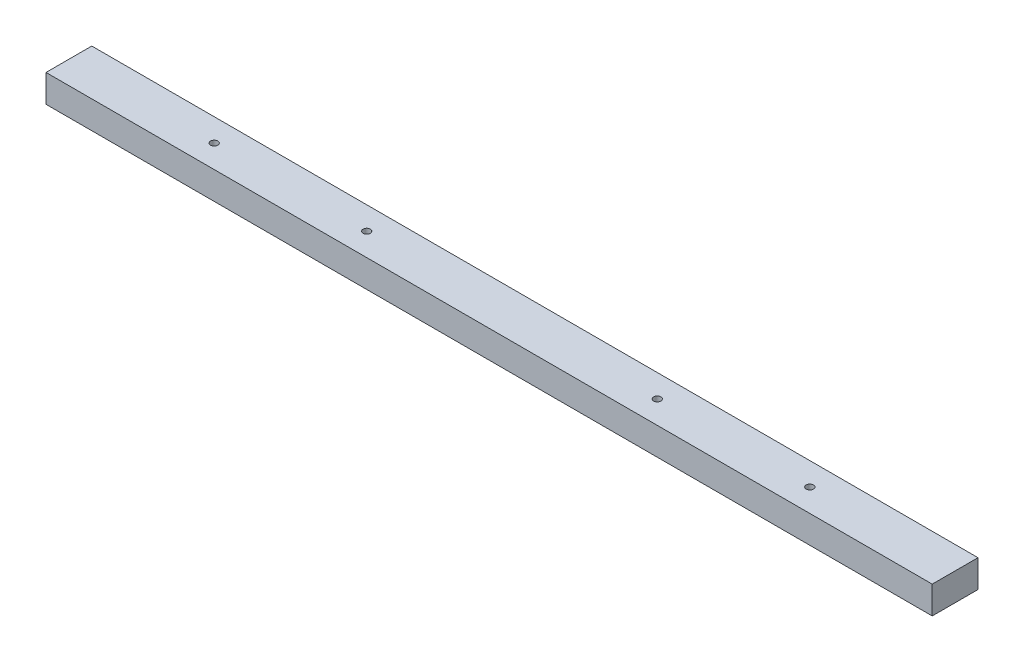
ISO-10303-21;
HEADER;
FILE_DESCRIPTION(('STEP AP214'),'2;1');
FILE_NAME('part.step','',(''),(''),'','','');
FILE_SCHEMA(('AUTOMOTIVE_DESIGN { 1 0 10303 214 1 1 1 1 }'));
ENDSEC;
DATA;
#1=APPLICATION_CONTEXT('core data for automotive mechanical design processes');
#2=APPLICATION_PROTOCOL_DEFINITION('international standard','automotive_design',2000,#1);
#3=PRODUCT_CONTEXT('',#1,'mechanical');
#4=PRODUCT('Part','Part','',(#3));
#5=PRODUCT_RELATED_PRODUCT_CATEGORY('part','',(#4));
#6=PRODUCT_DEFINITION_FORMATION('','',#4);
#7=PRODUCT_DEFINITION_CONTEXT('part definition',#1,'design');
#8=PRODUCT_DEFINITION('design','',#6,#7);
#9=PRODUCT_DEFINITION_SHAPE('','',#8);
#10=(LENGTH_UNIT() NAMED_UNIT(*) SI_UNIT(.MILLI.,.METRE.));
#11=(NAMED_UNIT(*) PLANE_ANGLE_UNIT() SI_UNIT($,.RADIAN.));
#12=(NAMED_UNIT(*) SI_UNIT($,.STERADIAN.) SOLID_ANGLE_UNIT());
#13=UNCERTAINTY_MEASURE_WITH_UNIT(LENGTH_MEASURE(1.E-05),#10,'distance_accuracy_value','');
#14=(GEOMETRIC_REPRESENTATION_CONTEXT(3) GLOBAL_UNCERTAINTY_ASSIGNED_CONTEXT((#13)) GLOBAL_UNIT_ASSIGNED_CONTEXT((#10,
#11,#12)) REPRESENTATION_CONTEXT('',''));
#15=CARTESIAN_POINT('',(0.,0.,0.));
#16=DIRECTION('',(0.,0.,1.));
#17=DIRECTION('',(1.,0.,0.));
#18=AXIS2_PLACEMENT_3D('',#15,#16,#17);
#19=CARTESIAN_POINT('',(0.,38.,0.));
#20=DIRECTION('',(1.,0.,0.));
#21=DIRECTION('',(0.,0.,-1.));
#22=AXIS2_PLACEMENT_3D('',#19,#20,#21);
#23=PLANE('',#22);
#24=DIRECTION('',(0.,0.,1.));
#25=VECTOR('',#24,1.);
#26=CARTESIAN_POINT('',(0.,0.,0.));
#27=LINE('',#26,#25);
#28=CARTESIAN_POINT('',(0.,0.,-63.));
#29=VERTEX_POINT('',#28);
#30=CARTESIAN_POINT('',(0.,0.,0.));
#31=VERTEX_POINT('',#30);
#32=EDGE_CURVE('E96',#29,#31,#27,.T.);
#33=ORIENTED_EDGE('',*,*,#32,.T.);
#34=DIRECTION('',(0.,-1.,0.));
#35=VECTOR('',#34,1.);
#36=CARTESIAN_POINT('',(0.,38.,0.));
#37=LINE('',#36,#35);
#38=CARTESIAN_POINT('',(0.,38.,0.));
#39=VERTEX_POINT('',#38);
#40=EDGE_CURVE('E11',#39,#31,#37,.T.);
#41=ORIENTED_EDGE('',*,*,#40,.F.);
#42=DIRECTION('',(0.,0.,1.));
#43=VECTOR('',#42,1.);
#44=CARTESIAN_POINT('',(0.,38.,0.));
#45=LINE('',#44,#43);
#46=CARTESIAN_POINT('',(0.,38.,-63.));
#47=VERTEX_POINT('',#46);
#48=EDGE_CURVE('E84',#47,#39,#45,.T.);
#49=ORIENTED_EDGE('',*,*,#48,.F.);
#50=DIRECTION('',(0.,-1.,0.));
#51=VECTOR('',#50,1.);
#52=CARTESIAN_POINT('',(0.,38.,-63.));
#53=LINE('',#52,#51);
#54=EDGE_CURVE('E92',#47,#29,#53,.T.);
#55=ORIENTED_EDGE('',*,*,#54,.T.);
#56=EDGE_LOOP('',(#33,#41,#49,#55));
#57=FACE_BOUND('',#56,.T.);
#58=ADVANCED_FACE('F33',(#57),#23,.F.);
#59=CARTESIAN_POINT('',(0.,38.,0.));
#60=DIRECTION('',(0.,0.,-1.));
#61=DIRECTION('',(-1.,0.,0.));
#62=AXIS2_PLACEMENT_3D('',#59,#60,#61);
#63=PLANE('',#62);
#64=DIRECTION('',(1.,0.,0.));
#65=VECTOR('',#64,1.);
#66=CARTESIAN_POINT('',(0.,0.,0.));
#67=LINE('',#66,#65);
#68=CARTESIAN_POINT('',(1220.,0.,0.));
#69=VERTEX_POINT('',#68);
#70=EDGE_CURVE('E88',#31,#69,#67,.T.);
#71=ORIENTED_EDGE('',*,*,#70,.T.);
#72=DIRECTION('',(0.,-1.,0.));
#73=VECTOR('',#72,1.);
#74=CARTESIAN_POINT('',(1220.,38.,0.));
#75=LINE('',#74,#73);
#76=CARTESIAN_POINT('',(1220.,38.,0.));
#77=VERTEX_POINT('',#76);
#78=EDGE_CURVE('E41',#77,#69,#75,.T.);
#79=ORIENTED_EDGE('',*,*,#78,.F.);
#80=DIRECTION('',(1.,0.,0.));
#81=VECTOR('',#80,1.);
#82=CARTESIAN_POINT('',(0.,38.,0.));
#83=LINE('',#82,#81);
#84=EDGE_CURVE('E79',#39,#77,#83,.T.);
#85=ORIENTED_EDGE('',*,*,#84,.F.);
#86=ORIENTED_EDGE('',*,*,#40,.T.);
#87=EDGE_LOOP('',(#71,#79,#85,#86));
#88=FACE_BOUND('',#87,.T.);
#89=ADVANCED_FACE('F87',(#88),#63,.F.);
#90=CARTESIAN_POINT('',(1220.,38.,0.));
#91=DIRECTION('',(-1.,0.,0.));
#92=DIRECTION('',(0.,0.,1.));
#93=AXIS2_PLACEMENT_3D('',#90,#91,#92);
#94=PLANE('',#93);
#95=DIRECTION('',(0.,0.,-1.));
#96=VECTOR('',#95,1.);
#97=CARTESIAN_POINT('',(1220.,0.,0.));
#98=LINE('',#97,#96);
#99=CARTESIAN_POINT('',(1220.,0.,-63.));
#100=VERTEX_POINT('',#99);
#101=EDGE_CURVE('E66',#69,#100,#98,.T.);
#102=ORIENTED_EDGE('',*,*,#101,.T.);
#103=DIRECTION('',(0.,-1.,0.));
#104=VECTOR('',#103,1.);
#105=CARTESIAN_POINT('',(1220.,38.,-63.));
#106=LINE('',#105,#104);
#107=CARTESIAN_POINT('',(1220.,38.,-63.));
#108=VERTEX_POINT('',#107);
#109=EDGE_CURVE('E89',#108,#100,#106,.T.);
#110=ORIENTED_EDGE('',*,*,#109,.F.);
#111=DIRECTION('',(0.,0.,-1.));
#112=VECTOR('',#111,1.);
#113=CARTESIAN_POINT('',(1220.,38.,0.));
#114=LINE('',#113,#112);
#115=EDGE_CURVE('E82',#77,#108,#114,.T.);
#116=ORIENTED_EDGE('',*,*,#115,.F.);
#117=ORIENTED_EDGE('',*,*,#78,.T.);
#118=EDGE_LOOP('',(#102,#110,#116,#117));
#119=FACE_BOUND('',#118,.T.);
#120=ADVANCED_FACE('F90',(#119),#94,.F.);
#121=CARTESIAN_POINT('',(0.,38.,-63.));
#122=DIRECTION('',(0.,0.,1.));
#123=DIRECTION('',(1.,0.,0.));
#124=AXIS2_PLACEMENT_3D('',#121,#122,#123);
#125=PLANE('',#124);
#126=DIRECTION('',(-1.,0.,0.));
#127=VECTOR('',#126,1.);
#128=CARTESIAN_POINT('',(0.,0.,-63.));
#129=LINE('',#128,#127);
#130=EDGE_CURVE('E72',#100,#29,#129,.T.);
#131=ORIENTED_EDGE('',*,*,#130,.T.);
#132=ORIENTED_EDGE('',*,*,#54,.F.);
#133=DIRECTION('',(-1.,0.,0.));
#134=VECTOR('',#133,1.);
#135=CARTESIAN_POINT('',(0.,38.,-63.));
#136=LINE('',#135,#134);
#137=EDGE_CURVE('E49',#108,#47,#136,.T.);
#138=ORIENTED_EDGE('',*,*,#137,.F.);
#139=ORIENTED_EDGE('',*,*,#109,.T.);
#140=EDGE_LOOP('',(#131,#132,#138,#139));
#141=FACE_BOUND('',#140,.T.);
#142=ADVANCED_FACE('F104',(#141),#125,.F.);
#143=CARTESIAN_POINT('',(0.,38.,0.));
#144=DIRECTION('',(0.,-1.,0.));
#145=DIRECTION('',(0.,0.,-1.));
#146=AXIS2_PLACEMENT_3D('',#143,#144,#145);
#147=PLANE('',#146);
#148=CARTESIAN_POINT('',(200.,38.,-31.5));
#149=DIRECTION('',(0.,1.,0.));
#150=DIRECTION('',(0.,0.,1.));
#151=AXIS2_PLACEMENT_3D('',#148,#149,#150);
#152=CIRCLE('',#151,4.99999999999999);
#153=CARTESIAN_POINT('',(200.,38.,-26.5));
#154=VERTEX_POINT('',#153);
#155=EDGE_CURVE('E128',#154,#154,#152,.T.);
#156=ORIENTED_EDGE('',*,*,#155,.F.);
#157=EDGE_LOOP('',(#156));
#158=FACE_BOUND('',#157,.T.);
#159=CARTESIAN_POINT('',(410.,38.,-31.5));
#160=DIRECTION('',(0.,1.,0.));
#161=DIRECTION('',(0.,0.,1.));
#162=AXIS2_PLACEMENT_3D('',#159,#160,#161);
#163=CIRCLE('',#162,5.00000000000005);
#164=CARTESIAN_POINT('',(410.,38.,-26.5));
#165=VERTEX_POINT('',#164);
#166=EDGE_CURVE('E122',#165,#165,#163,.T.);
#167=ORIENTED_EDGE('',*,*,#166,.F.);
#168=EDGE_LOOP('',(#167));
#169=FACE_BOUND('',#168,.T.);
#170=CARTESIAN_POINT('',(810.,38.,-31.5));
#171=DIRECTION('',(0.,1.,0.));
#172=DIRECTION('',(0.,0.,-1.));
#173=AXIS2_PLACEMENT_3D('',#170,#171,#172);
#174=CIRCLE('',#173,5.00000000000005);
#175=CARTESIAN_POINT('',(810.,38.,-36.5));
#176=VERTEX_POINT('',#175);
#177=EDGE_CURVE('E116',#176,#176,#174,.T.);
#178=ORIENTED_EDGE('',*,*,#177,.F.);
#179=EDGE_LOOP('',(#178));
#180=FACE_BOUND('',#179,.T.);
#181=CARTESIAN_POINT('',(1020.,38.,-31.5));
#182=DIRECTION('',(0.,1.,0.));
#183=DIRECTION('',(0.,0.,-1.));
#184=AXIS2_PLACEMENT_3D('',#181,#182,#183);
#185=CIRCLE('',#184,5.00000000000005);
#186=CARTESIAN_POINT('',(1020.,38.,-36.5));
#187=VERTEX_POINT('',#186);
#188=EDGE_CURVE('E110',#187,#187,#185,.T.);
#189=ORIENTED_EDGE('',*,*,#188,.F.);
#190=EDGE_LOOP('',(#189));
#191=FACE_BOUND('',#190,.T.);
#192=ORIENTED_EDGE('',*,*,#48,.T.);
#193=ORIENTED_EDGE('',*,*,#84,.T.);
#194=ORIENTED_EDGE('',*,*,#115,.T.);
#195=ORIENTED_EDGE('',*,*,#137,.T.);
#196=EDGE_LOOP('',(#192,#193,#194,#195));
#197=FACE_BOUND('',#196,.T.);
#198=ADVANCED_FACE('F80',(#158,#169,#180,#191,#197),#147,.F.);
#199=CARTESIAN_POINT('',(0.,0.,0.));
#200=DIRECTION('',(0.,-1.,0.));
#201=DIRECTION('',(0.,0.,-1.));
#202=AXIS2_PLACEMENT_3D('',#199,#200,#201);
#203=PLANE('',#202);
#204=CARTESIAN_POINT('',(200.,0.,-31.5));
#205=DIRECTION('',(0.,1.,0.));
#206=DIRECTION('',(0.,0.,1.));
#207=AXIS2_PLACEMENT_3D('',#204,#205,#206);
#208=CIRCLE('',#207,4.99999999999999);
#209=CARTESIAN_POINT('',(200.,0.,-26.5));
#210=VERTEX_POINT('',#209);
#211=EDGE_CURVE('E99',#210,#210,#208,.T.);
#212=ORIENTED_EDGE('',*,*,#211,.T.);
#213=EDGE_LOOP('',(#212));
#214=FACE_BOUND('',#213,.T.);
#215=CARTESIAN_POINT('',(410.,0.,-31.5));
#216=DIRECTION('',(0.,1.,0.));
#217=DIRECTION('',(0.,0.,1.));
#218=AXIS2_PLACEMENT_3D('',#215,#216,#217);
#219=CIRCLE('',#218,5.00000000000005);
#220=CARTESIAN_POINT('',(410.,0.,-26.5));
#221=VERTEX_POINT('',#220);
#222=EDGE_CURVE('E125',#221,#221,#219,.T.);
#223=ORIENTED_EDGE('',*,*,#222,.T.);
#224=EDGE_LOOP('',(#223));
#225=FACE_BOUND('',#224,.T.);
#226=CARTESIAN_POINT('',(810.,0.,-31.5));
#227=DIRECTION('',(0.,1.,0.));
#228=DIRECTION('',(0.,0.,-1.));
#229=AXIS2_PLACEMENT_3D('',#226,#227,#228);
#230=CIRCLE('',#229,5.00000000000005);
#231=CARTESIAN_POINT('',(810.,0.,-36.5));
#232=VERTEX_POINT('',#231);
#233=EDGE_CURVE('E119',#232,#232,#230,.T.);
#234=ORIENTED_EDGE('',*,*,#233,.T.);
#235=EDGE_LOOP('',(#234));
#236=FACE_BOUND('',#235,.T.);
#237=CARTESIAN_POINT('',(1020.,0.,-31.5));
#238=DIRECTION('',(0.,1.,0.));
#239=DIRECTION('',(0.,0.,-1.));
#240=AXIS2_PLACEMENT_3D('',#237,#238,#239);
#241=CIRCLE('',#240,5.00000000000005);
#242=CARTESIAN_POINT('',(1020.,0.,-36.5));
#243=VERTEX_POINT('',#242);
#244=EDGE_CURVE('E113',#243,#243,#241,.T.);
#245=ORIENTED_EDGE('',*,*,#244,.T.);
#246=EDGE_LOOP('',(#245));
#247=FACE_BOUND('',#246,.T.);
#248=ORIENTED_EDGE('',*,*,#32,.F.);
#249=ORIENTED_EDGE('',*,*,#130,.F.);
#250=ORIENTED_EDGE('',*,*,#101,.F.);
#251=ORIENTED_EDGE('',*,*,#70,.F.);
#252=EDGE_LOOP('',(#248,#249,#250,#251));
#253=FACE_BOUND('',#252,.T.);
#254=ADVANCED_FACE('F107',(#214,#225,#236,#247,#253),#203,.T.);
#255=CARTESIAN_POINT('',(1020.,0.,-31.5));
#256=DIRECTION('',(0.,1.,0.));
#257=DIRECTION('',(0.,0.,1.));
#258=AXIS2_PLACEMENT_3D('',#255,#256,#257);
#259=CYLINDRICAL_SURFACE('',#258,5.00000000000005);
#260=ORIENTED_EDGE('',*,*,#244,.F.);
#261=EDGE_LOOP('',(#260));
#262=FACE_BOUND('',#261,.T.);
#263=ORIENTED_EDGE('',*,*,#188,.T.);
#264=EDGE_LOOP('',(#263));
#265=FACE_BOUND('',#264,.T.);
#266=ADVANCED_FACE('F152',(#262,#265),#259,.F.);
#267=CARTESIAN_POINT('',(810.,0.,-31.5));
#268=DIRECTION('',(0.,1.,0.));
#269=DIRECTION('',(0.,0.,1.));
#270=AXIS2_PLACEMENT_3D('',#267,#268,#269);
#271=CYLINDRICAL_SURFACE('',#270,5.00000000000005);
#272=ORIENTED_EDGE('',*,*,#233,.F.);
#273=EDGE_LOOP('',(#272));
#274=FACE_BOUND('',#273,.T.);
#275=ORIENTED_EDGE('',*,*,#177,.T.);
#276=EDGE_LOOP('',(#275));
#277=FACE_BOUND('',#276,.T.);
#278=ADVANCED_FACE('F154',(#274,#277),#271,.F.);
#279=CARTESIAN_POINT('',(410.,0.,-31.5));
#280=DIRECTION('',(0.,1.,0.));
#281=DIRECTION('',(0.,0.,1.));
#282=AXIS2_PLACEMENT_3D('',#279,#280,#281);
#283=CYLINDRICAL_SURFACE('',#282,5.00000000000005);
#284=ORIENTED_EDGE('',*,*,#222,.F.);
#285=EDGE_LOOP('',(#284));
#286=FACE_BOUND('',#285,.T.);
#287=ORIENTED_EDGE('',*,*,#166,.T.);
#288=EDGE_LOOP('',(#287));
#289=FACE_BOUND('',#288,.T.);
#290=ADVANCED_FACE('F139',(#286,#289),#283,.F.);
#291=CARTESIAN_POINT('',(200.,0.,-31.5));
#292=DIRECTION('',(0.,1.,0.));
#293=DIRECTION('',(0.,0.,1.));
#294=AXIS2_PLACEMENT_3D('',#291,#292,#293);
#295=CYLINDRICAL_SURFACE('',#294,4.99999999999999);
#296=ORIENTED_EDGE('',*,*,#211,.F.);
#297=EDGE_LOOP('',(#296));
#298=FACE_BOUND('',#297,.T.);
#299=ORIENTED_EDGE('',*,*,#155,.T.);
#300=EDGE_LOOP('',(#299));
#301=FACE_BOUND('',#300,.T.);
#302=ADVANCED_FACE('F136',(#298,#301),#295,.F.);
#303=CLOSED_SHELL('',(#58,#89,#120,#142,#198,#254,#266,#278,#290,#302));
#304=MANIFOLD_SOLID_BREP('B2',#303);
#305=ADVANCED_BREP_SHAPE_REPRESENTATION('',(#18,#304),#14);
#306=SHAPE_DEFINITION_REPRESENTATION(#9,#305);
ENDSEC;
END-ISO-10303-21;
